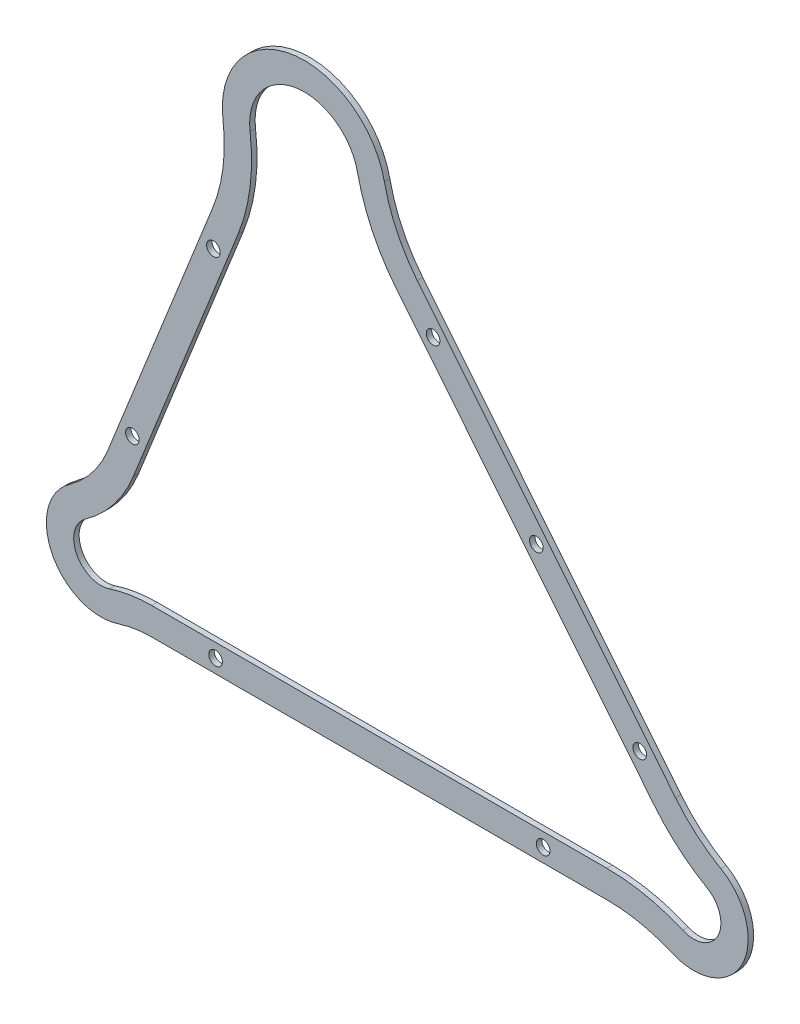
from build123d import *

# Parameters (mm, degrees)
SKETCH4_R      = 3.175
EXTRUDE1_DEPTH = 2.54


with BuildPart() as part:
    # Sketch4 → Extrude1 (new body)
    with BuildSketch(Plane.XY.offset(12.7)):
        with BuildLine():
            Line((97.234559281, -71.023035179), (-22.882062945, 77.261904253))
            ThreePointArc((-22.882062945, 77.261904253), (-32.474205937, 92.47544239), (-38.233506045, 109.513382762))
            ThreePointArc((-38.233506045, 109.513382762), (-81.862342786, 139.224972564), (-113.307544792, 96.828590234))
            ThreePointArc((-113.307544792, 96.828590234), (-113.302293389, 77.554332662), (-118.133351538, 58.895342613))
            Line((-118.133351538, 58.895342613), (-166.876279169, -63.08417404))
            ThreePointArc((-166.876279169, -63.08417404), (-174.165779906, -75.697073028), (-184.735159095, -85.722553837))
            ThreePointArc((-184.735159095, -85.722553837), (-192.775650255, -117.867716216), (-162.188363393, -130.610512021))
            ThreePointArc((-162.188363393, -130.610512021), (-154.398106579, -128.729835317), (-146.409023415, -128.097699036))
            Line((-146.409023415, -128.097699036), (65.308297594, -128.097699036))
            ThreePointArc((65.308297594, -128.097699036), (80.756662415, -129.680087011), (95.563418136, -134.361530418))
            ThreePointArc((95.563418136, -134.361530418), (128.340887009, -122.460595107), (118.347766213, -89.052029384))
            ThreePointArc((118.347766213, -89.052029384), (106.963125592, -81.007221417), (97.234559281, -71.023035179))
        make_face()
        with Locations((-117.757824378, 42.722421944)):
            Circle(SKETCH4_R, mode=Mode.SUBTRACT)
        with Locations((-155.458523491, -51.623840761)):
            Circle(SKETCH4_R, mode=Mode.SUBTRACT)
        with Locations((-15.560967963, 58.135623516)):
            Circle(SKETCH4_R, mode=Mode.SUBTRACT)
        with Locations((32.510406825, -1.208876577)):
            Circle(SKETCH4_R, mode=Mode.SUBTRACT)
        with Locations((80.581781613, -60.55337667)):
            Circle(SKETCH4_R, mode=Mode.SUBTRACT)
        with Locations((35.64963709, -121.747699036)):
            Circle(SKETCH4_R, mode=Mode.SUBTRACT)
        with Locations((-116.75036291, -121.747699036)):
            Circle(SKETCH4_R, mode=Mode.SUBTRACT)
        with BuildLine():
            Line((87.366037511, -79.016925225), (-32.750584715, 69.268014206))
            ThreePointArc((-32.750584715, 69.268014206), (-43.941418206, 87.017142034), (-50.660601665, 106.894739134))
            ThreePointArc((-50.660601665, 106.894739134), (-79.746492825, 126.702465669), (-100.70996083, 98.438210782))
            ThreePointArc((-100.70996083, 98.438210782), (-100.703834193, 75.951576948), (-106.3400687, 54.182755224))
            Line((-106.3400687, 54.182755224), (-155.082996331, -67.79676143))
            ThreePointArc((-155.082996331, -67.79676143), (-164.194872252, -83.562885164), (-177.406596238, -96.094736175))
            ThreePointArc((-177.406596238, -96.094736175), (-181.426841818, -112.167317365), (-166.133198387, -118.538715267))
            ThreePointArc((-166.133198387, -118.538715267), (-156.39537737, -116.187869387), (-146.409023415, -115.397699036))
            Line((-146.409023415, -115.397699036), (65.308297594, -115.397699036))
            ThreePointArc((65.308297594, -115.397699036), (83.331389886, -117.24381834), (100.605938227, -122.705502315))
            ThreePointArc((100.605938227, -122.705502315), (116.994672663, -116.75503466), (111.998112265, -100.050751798))
            ThreePointArc((111.998112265, -100.050751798), (98.716031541, -90.665142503), (87.366037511, -79.016925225))
        make_face(mode=Mode.SUBTRACT)
    extrude(amount=EXTRUDE1_DEPTH)


solid = part.part
